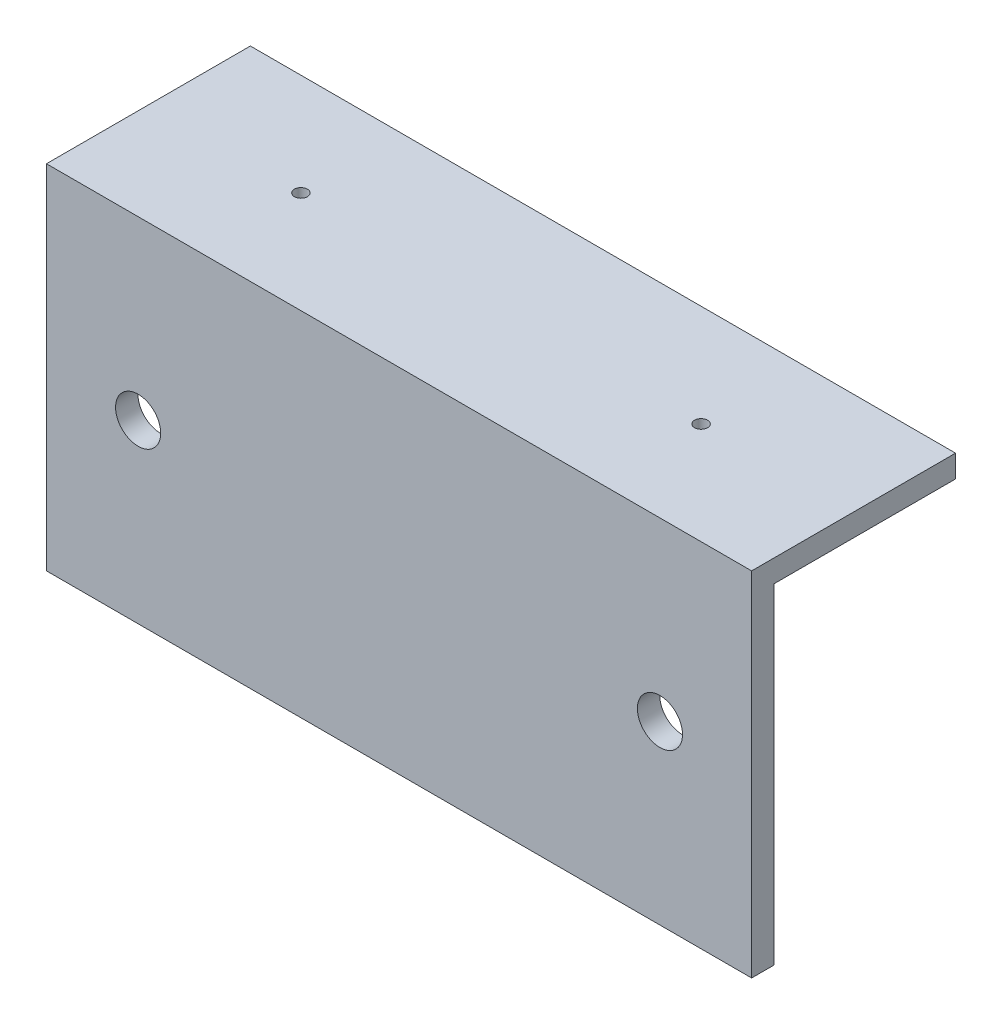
ISO-10303-21;
HEADER;
FILE_DESCRIPTION(('STEP AP214'),'2;1');
FILE_NAME('part.step','',(''),(''),'','','');
FILE_SCHEMA(('AUTOMOTIVE_DESIGN { 1 0 10303 214 1 1 1 1 }'));
ENDSEC;
DATA;
#1=APPLICATION_CONTEXT('core data for automotive mechanical design processes');
#2=APPLICATION_PROTOCOL_DEFINITION('international standard','automotive_design',2000,#1);
#3=PRODUCT_CONTEXT('',#1,'mechanical');
#4=PRODUCT('Part','Part','',(#3));
#5=PRODUCT_RELATED_PRODUCT_CATEGORY('part','',(#4));
#6=PRODUCT_DEFINITION_FORMATION('','',#4);
#7=PRODUCT_DEFINITION_CONTEXT('part definition',#1,'design');
#8=PRODUCT_DEFINITION('design','',#6,#7);
#9=PRODUCT_DEFINITION_SHAPE('','',#8);
#10=(LENGTH_UNIT() NAMED_UNIT(*) SI_UNIT(.MILLI.,.METRE.));
#11=(NAMED_UNIT(*) PLANE_ANGLE_UNIT() SI_UNIT($,.RADIAN.));
#12=(NAMED_UNIT(*) SI_UNIT($,.STERADIAN.) SOLID_ANGLE_UNIT());
#13=UNCERTAINTY_MEASURE_WITH_UNIT(LENGTH_MEASURE(1.E-05),#10,'distance_accuracy_value','');
#14=(GEOMETRIC_REPRESENTATION_CONTEXT(3) GLOBAL_UNCERTAINTY_ASSIGNED_CONTEXT((#13)) GLOBAL_UNIT_ASSIGNED_CONTEXT((#10,
#11,#12)) REPRESENTATION_CONTEXT('',''));
#15=CARTESIAN_POINT('',(0.,0.,0.));
#16=DIRECTION('',(0.,0.,1.));
#17=DIRECTION('',(1.,0.,0.));
#18=AXIS2_PLACEMENT_3D('',#15,#16,#17);
#19=CARTESIAN_POINT('',(25.,0.,1.5875));
#20=DIRECTION('',(-1.,0.,0.));
#21=DIRECTION('',(0.,0.,1.));
#22=AXIS2_PLACEMENT_3D('',#19,#20,#21);
#23=PLANE('',#22);
#24=DIRECTION('',(0.,1.,0.));
#25=VECTOR('',#24,1.);
#26=CARTESIAN_POINT('',(25.,0.,0.));
#27=LINE('',#26,#25);
#28=CARTESIAN_POINT('',(25.,-12.5,0.));
#29=VERTEX_POINT('',#28);
#30=CARTESIAN_POINT('',(25.,10.9125,0.));
#31=VERTEX_POINT('',#30);
#32=EDGE_CURVE('E118',#29,#31,#27,.T.);
#33=ORIENTED_EDGE('',*,*,#32,.T.);
#34=DIRECTION('',(0.,0.,-1.));
#35=VECTOR('',#34,1.);
#36=CARTESIAN_POINT('',(25.,10.9125,0.));
#37=LINE('',#36,#35);
#38=CARTESIAN_POINT('',(25.,10.9125,-12.8709783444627));
#39=VERTEX_POINT('',#38);
#40=EDGE_CURVE('E52',#31,#39,#37,.T.);
#41=ORIENTED_EDGE('',*,*,#40,.T.);
#42=DIRECTION('',(0.,1.,0.));
#43=VECTOR('',#42,1.);
#44=CARTESIAN_POINT('',(25.,10.9125,-12.8709783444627));
#45=LINE('',#44,#43);
#46=CARTESIAN_POINT('',(25.,12.5,-12.8709783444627));
#47=VERTEX_POINT('',#46);
#48=EDGE_CURVE('E101',#39,#47,#45,.T.);
#49=ORIENTED_EDGE('',*,*,#48,.T.);
#50=DIRECTION('',(0.,0.,-1.));
#51=VECTOR('',#50,1.);
#52=CARTESIAN_POINT('',(25.,12.5,1.5875));
#53=LINE('',#52,#51);
#54=CARTESIAN_POINT('',(25.,12.5,1.5875));
#55=VERTEX_POINT('',#54);
#56=EDGE_CURVE('E11',#55,#47,#53,.T.);
#57=ORIENTED_EDGE('',*,*,#56,.F.);
#58=DIRECTION('',(0.,1.,0.));
#59=VECTOR('',#58,1.);
#60=CARTESIAN_POINT('',(25.,0.,1.5875));
#61=LINE('',#60,#59);
#62=CARTESIAN_POINT('',(25.,-12.5,1.5875));
#63=VERTEX_POINT('',#62);
#64=EDGE_CURVE('E154',#63,#55,#61,.T.);
#65=ORIENTED_EDGE('',*,*,#64,.F.);
#66=DIRECTION('',(0.,0.,-1.));
#67=VECTOR('',#66,1.);
#68=CARTESIAN_POINT('',(25.,-12.5,1.5875));
#69=LINE('',#68,#67);
#70=EDGE_CURVE('E143',#63,#29,#69,.T.);
#71=ORIENTED_EDGE('',*,*,#70,.T.);
#72=EDGE_LOOP('',(#33,#41,#49,#57,#65,#71));
#73=FACE_BOUND('',#72,.T.);
#74=ADVANCED_FACE('F35',(#73),#23,.F.);
#75=CARTESIAN_POINT('',(0.,12.5,1.5875));
#76=DIRECTION('',(0.,-1.,0.));
#77=DIRECTION('',(0.,0.,-1.));
#78=AXIS2_PLACEMENT_3D('',#75,#76,#77);
#79=PLANE('',#78);
#80=CARTESIAN_POINT('',(-14.1859,12.5,-5.64173917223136));
#81=DIRECTION('',(0.,1.,0.));
#82=DIRECTION('',(0.,0.,1.));
#83=AXIS2_PLACEMENT_3D('',#80,#81,#82);
#84=CIRCLE('',#83,0.46355);
#85=CARTESIAN_POINT('',(-14.1859,12.5,-5.17818917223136));
#86=VERTEX_POINT('',#85);
#87=EDGE_CURVE('E216',#86,#86,#84,.T.);
#88=ORIENTED_EDGE('',*,*,#87,.F.);
#89=EDGE_LOOP('',(#88));
#90=FACE_BOUND('',#89,.T.);
#91=CARTESIAN_POINT('',(14.1859,12.5,-5.64173917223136));
#92=DIRECTION('',(0.,1.,0.));
#93=DIRECTION('',(0.,0.,1.));
#94=AXIS2_PLACEMENT_3D('',#91,#92,#93);
#95=CIRCLE('',#94,0.46355);
#96=CARTESIAN_POINT('',(14.1859,12.5,-5.17818917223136));
#97=VERTEX_POINT('',#96);
#98=EDGE_CURVE('E218',#97,#97,#95,.T.);
#99=ORIENTED_EDGE('',*,*,#98,.F.);
#100=EDGE_LOOP('',(#99));
#101=FACE_BOUND('',#100,.T.);
#102=ORIENTED_EDGE('',*,*,#56,.T.);
#103=DIRECTION('',(-1.,0.,0.));
#104=VECTOR('',#103,1.);
#105=CARTESIAN_POINT('',(25.,12.5,-12.8709783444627));
#106=LINE('',#105,#104);
#107=CARTESIAN_POINT('',(-25.,12.5,-12.8709783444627));
#108=VERTEX_POINT('',#107);
#109=EDGE_CURVE('E106',#47,#108,#106,.T.);
#110=ORIENTED_EDGE('',*,*,#109,.T.);
#111=DIRECTION('',(0.,0.,-1.));
#112=VECTOR('',#111,1.);
#113=CARTESIAN_POINT('',(-25.,12.5,1.5875));
#114=LINE('',#113,#112);
#115=CARTESIAN_POINT('',(-25.,12.5,1.5875));
#116=VERTEX_POINT('',#115);
#117=EDGE_CURVE('E44',#116,#108,#114,.T.);
#118=ORIENTED_EDGE('',*,*,#117,.F.);
#119=DIRECTION('',(-1.,0.,0.));
#120=VECTOR('',#119,1.);
#121=CARTESIAN_POINT('',(0.,12.5,1.5875));
#122=LINE('',#121,#120);
#123=EDGE_CURVE('E83',#55,#116,#122,.T.);
#124=ORIENTED_EDGE('',*,*,#123,.F.);
#125=EDGE_LOOP('',(#102,#110,#118,#124));
#126=FACE_BOUND('',#125,.T.);
#127=ADVANCED_FACE('F152',(#90,#101,#126),#79,.F.);
#128=CARTESIAN_POINT('',(-25.,0.,1.5875));
#129=DIRECTION('',(1.,0.,0.));
#130=DIRECTION('',(0.,0.,-1.));
#131=AXIS2_PLACEMENT_3D('',#128,#129,#130);
#132=PLANE('',#131);
#133=ORIENTED_EDGE('',*,*,#117,.T.);
#134=DIRECTION('',(0.,1.,0.));
#135=VECTOR('',#134,1.);
#136=CARTESIAN_POINT('',(-25.,10.9125,-12.8709783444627));
#137=LINE('',#136,#135);
#138=CARTESIAN_POINT('',(-25.,10.9125,-12.8709783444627));
#139=VERTEX_POINT('',#138);
#140=EDGE_CURVE('E109',#139,#108,#137,.T.);
#141=ORIENTED_EDGE('',*,*,#140,.F.);
#142=DIRECTION('',(0.,0.,1.));
#143=VECTOR('',#142,1.);
#144=CARTESIAN_POINT('',(-25.,10.9125,-12.8709783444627));
#145=LINE('',#144,#143);
#146=CARTESIAN_POINT('',(-25.,10.9125,0.));
#147=VERTEX_POINT('',#146);
#148=EDGE_CURVE('E114',#139,#147,#145,.T.);
#149=ORIENTED_EDGE('',*,*,#148,.T.);
#150=DIRECTION('',(0.,-1.,0.));
#151=VECTOR('',#150,1.);
#152=CARTESIAN_POINT('',(-25.,0.,0.));
#153=LINE('',#152,#151);
#154=CARTESIAN_POINT('',(-25.,-12.5,0.));
#155=VERTEX_POINT('',#154);
#156=EDGE_CURVE('E131',#147,#155,#153,.T.);
#157=ORIENTED_EDGE('',*,*,#156,.T.);
#158=DIRECTION('',(0.,0.,-1.));
#159=VECTOR('',#158,1.);
#160=CARTESIAN_POINT('',(-25.,-12.5,1.5875));
#161=LINE('',#160,#159);
#162=CARTESIAN_POINT('',(-25.,-12.5,1.5875));
#163=VERTEX_POINT('',#162);
#164=EDGE_CURVE('E145',#163,#155,#161,.T.);
#165=ORIENTED_EDGE('',*,*,#164,.F.);
#166=DIRECTION('',(0.,-1.,0.));
#167=VECTOR('',#166,1.);
#168=CARTESIAN_POINT('',(-25.,0.,1.5875));
#169=LINE('',#168,#167);
#170=EDGE_CURVE('E149',#116,#163,#169,.T.);
#171=ORIENTED_EDGE('',*,*,#170,.F.);
#172=EDGE_LOOP('',(#133,#141,#149,#157,#165,#171));
#173=FACE_BOUND('',#172,.T.);
#174=ADVANCED_FACE('F148',(#173),#132,.F.);
#175=CARTESIAN_POINT('',(-18.5,0.,1.5875));
#176=DIRECTION('',(0.,0.,-1.));
#177=DIRECTION('',(-1.,0.,0.));
#178=AXIS2_PLACEMENT_3D('',#175,#176,#177);
#179=CYLINDRICAL_SURFACE('',#178,1.6);
#180=CARTESIAN_POINT('',(-18.5,0.,1.5875));
#181=DIRECTION('',(0.,0.,1.));
#182=DIRECTION('',(1.,0.,0.));
#183=AXIS2_PLACEMENT_3D('',#180,#181,#182);
#184=CIRCLE('',#183,1.6);
#185=CARTESIAN_POINT('',(-16.9,0.,1.5875));
#186=VERTEX_POINT('',#185);
#187=EDGE_CURVE('E155',#186,#186,#184,.T.);
#188=ORIENTED_EDGE('',*,*,#187,.T.);
#189=EDGE_LOOP('',(#188));
#190=FACE_BOUND('',#189,.T.);
#191=CARTESIAN_POINT('',(-18.5,0.,0.));
#192=DIRECTION('',(0.,0.,1.));
#193=DIRECTION('',(1.,0.,0.));
#194=AXIS2_PLACEMENT_3D('',#191,#192,#193);
#195=CIRCLE('',#194,1.6);
#196=CARTESIAN_POINT('',(-16.9,0.,0.));
#197=VERTEX_POINT('',#196);
#198=EDGE_CURVE('E135',#197,#197,#195,.T.);
#199=ORIENTED_EDGE('',*,*,#198,.F.);
#200=EDGE_LOOP('',(#199));
#201=FACE_BOUND('',#200,.T.);
#202=ADVANCED_FACE('F169',(#190,#201),#179,.F.);
#203=CARTESIAN_POINT('',(18.5,0.,1.5875));
#204=DIRECTION('',(0.,0.,-1.));
#205=DIRECTION('',(-1.,0.,0.));
#206=AXIS2_PLACEMENT_3D('',#203,#204,#205);
#207=CYLINDRICAL_SURFACE('',#206,1.6);
#208=CARTESIAN_POINT('',(18.5,0.,1.5875));
#209=DIRECTION('',(0.,0.,1.));
#210=DIRECTION('',(1.,0.,0.));
#211=AXIS2_PLACEMENT_3D('',#208,#209,#210);
#212=CIRCLE('',#211,1.6);
#213=CARTESIAN_POINT('',(20.1,0.,1.5875));
#214=VERTEX_POINT('',#213);
#215=EDGE_CURVE('E133',#214,#214,#212,.T.);
#216=ORIENTED_EDGE('',*,*,#215,.T.);
#217=EDGE_LOOP('',(#216));
#218=FACE_BOUND('',#217,.T.);
#219=CARTESIAN_POINT('',(18.5,0.,0.));
#220=DIRECTION('',(0.,0.,1.));
#221=DIRECTION('',(1.,0.,0.));
#222=AXIS2_PLACEMENT_3D('',#219,#220,#221);
#223=CIRCLE('',#222,1.6);
#224=CARTESIAN_POINT('',(20.1,0.,0.));
#225=VERTEX_POINT('',#224);
#226=EDGE_CURVE('E150',#225,#225,#223,.T.);
#227=ORIENTED_EDGE('',*,*,#226,.F.);
#228=EDGE_LOOP('',(#227));
#229=FACE_BOUND('',#228,.T.);
#230=ADVANCED_FACE('F37',(#218,#229),#207,.F.);
#231=CARTESIAN_POINT('',(0.,-12.5,1.5875));
#232=DIRECTION('',(0.,1.,0.));
#233=DIRECTION('',(0.,0.,1.));
#234=AXIS2_PLACEMENT_3D('',#231,#232,#233);
#235=PLANE('',#234);
#236=DIRECTION('',(1.,0.,0.));
#237=VECTOR('',#236,1.);
#238=CARTESIAN_POINT('',(0.,-12.5,0.));
#239=LINE('',#238,#237);
#240=EDGE_CURVE('E76',#155,#29,#239,.T.);
#241=ORIENTED_EDGE('',*,*,#240,.T.);
#242=ORIENTED_EDGE('',*,*,#70,.F.);
#243=DIRECTION('',(1.,0.,0.));
#244=VECTOR('',#243,1.);
#245=CARTESIAN_POINT('',(0.,-12.5,1.5875));
#246=LINE('',#245,#244);
#247=EDGE_CURVE('E61',#163,#63,#246,.T.);
#248=ORIENTED_EDGE('',*,*,#247,.F.);
#249=ORIENTED_EDGE('',*,*,#164,.T.);
#250=EDGE_LOOP('',(#241,#242,#248,#249));
#251=FACE_BOUND('',#250,.T.);
#252=ADVANCED_FACE('F176',(#251),#235,.F.);
#253=CARTESIAN_POINT('',(0.,0.,1.5875));
#254=DIRECTION('',(0.,0.,1.));
#255=DIRECTION('',(1.,0.,0.));
#256=AXIS2_PLACEMENT_3D('',#253,#254,#255);
#257=PLANE('',#256);
#258=ORIENTED_EDGE('',*,*,#215,.F.);
#259=EDGE_LOOP('',(#258));
#260=FACE_BOUND('',#259,.T.);
#261=ORIENTED_EDGE('',*,*,#187,.F.);
#262=EDGE_LOOP('',(#261));
#263=FACE_BOUND('',#262,.T.);
#264=ORIENTED_EDGE('',*,*,#64,.T.);
#265=ORIENTED_EDGE('',*,*,#123,.T.);
#266=ORIENTED_EDGE('',*,*,#170,.T.);
#267=ORIENTED_EDGE('',*,*,#247,.T.);
#268=EDGE_LOOP('',(#264,#265,#266,#267));
#269=FACE_BOUND('',#268,.T.);
#270=ADVANCED_FACE('F189',(#260,#263,#269),#257,.T.);
#271=CARTESIAN_POINT('',(0.,0.,0.));
#272=DIRECTION('',(0.,0.,1.));
#273=DIRECTION('',(1.,0.,0.));
#274=AXIS2_PLACEMENT_3D('',#271,#272,#273);
#275=PLANE('',#274);
#276=ORIENTED_EDGE('',*,*,#226,.T.);
#277=EDGE_LOOP('',(#276));
#278=FACE_BOUND('',#277,.T.);
#279=ORIENTED_EDGE('',*,*,#198,.T.);
#280=EDGE_LOOP('',(#279));
#281=FACE_BOUND('',#280,.T.);
#282=ORIENTED_EDGE('',*,*,#156,.F.);
#283=DIRECTION('',(1.,0.,0.));
#284=VECTOR('',#283,1.);
#285=CARTESIAN_POINT('',(-25.,10.9125,0.));
#286=LINE('',#285,#284);
#287=EDGE_CURVE('E110',#147,#31,#286,.T.);
#288=ORIENTED_EDGE('',*,*,#287,.T.);
#289=ORIENTED_EDGE('',*,*,#32,.F.);
#290=ORIENTED_EDGE('',*,*,#240,.F.);
#291=EDGE_LOOP('',(#282,#288,#289,#290));
#292=FACE_BOUND('',#291,.T.);
#293=ADVANCED_FACE('F130',(#278,#281,#292),#275,.F.);
#294=CARTESIAN_POINT('',(25.,10.9125,-12.8709783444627));
#295=DIRECTION('',(0.,0.,-1.));
#296=DIRECTION('',(-1.,0.,0.));
#297=AXIS2_PLACEMENT_3D('',#294,#295,#296);
#298=PLANE('',#297);
#299=ORIENTED_EDGE('',*,*,#109,.F.);
#300=ORIENTED_EDGE('',*,*,#48,.F.);
#301=DIRECTION('',(-1.,0.,0.));
#302=VECTOR('',#301,1.);
#303=CARTESIAN_POINT('',(25.,10.9125,-12.8709783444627));
#304=LINE('',#303,#302);
#305=EDGE_CURVE('E104',#39,#139,#304,.T.);
#306=ORIENTED_EDGE('',*,*,#305,.T.);
#307=ORIENTED_EDGE('',*,*,#140,.T.);
#308=EDGE_LOOP('',(#299,#300,#306,#307));
#309=FACE_BOUND('',#308,.T.);
#310=ADVANCED_FACE('F102',(#309),#298,.T.);
#311=CARTESIAN_POINT('',(0.,10.9125,0.));
#312=DIRECTION('',(0.,1.,0.));
#313=DIRECTION('',(0.,0.,1.));
#314=AXIS2_PLACEMENT_3D('',#311,#312,#313);
#315=PLANE('',#314);
#316=CARTESIAN_POINT('',(-14.1859,10.9125,-5.64173917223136));
#317=DIRECTION('',(0.,1.,0.));
#318=DIRECTION('',(0.,0.,1.));
#319=AXIS2_PLACEMENT_3D('',#316,#317,#318);
#320=CIRCLE('',#319,0.46355);
#321=CARTESIAN_POINT('',(-14.1859,10.9125,-5.17818917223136));
#322=VERTEX_POINT('',#321);
#323=EDGE_CURVE('E213',#322,#322,#320,.T.);
#324=ORIENTED_EDGE('',*,*,#323,.T.);
#325=EDGE_LOOP('',(#324));
#326=FACE_BOUND('',#325,.T.);
#327=CARTESIAN_POINT('',(14.1859,10.9125,-5.64173917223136));
#328=DIRECTION('',(0.,1.,0.));
#329=DIRECTION('',(0.,0.,1.));
#330=AXIS2_PLACEMENT_3D('',#327,#328,#329);
#331=CIRCLE('',#330,0.46355);
#332=CARTESIAN_POINT('',(14.1859,10.9125,-5.17818917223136));
#333=VERTEX_POINT('',#332);
#334=EDGE_CURVE('E120',#333,#333,#331,.T.);
#335=ORIENTED_EDGE('',*,*,#334,.T.);
#336=EDGE_LOOP('',(#335));
#337=FACE_BOUND('',#336,.T.);
#338=ORIENTED_EDGE('',*,*,#40,.F.);
#339=ORIENTED_EDGE('',*,*,#287,.F.);
#340=ORIENTED_EDGE('',*,*,#148,.F.);
#341=ORIENTED_EDGE('',*,*,#305,.F.);
#342=EDGE_LOOP('',(#338,#339,#340,#341));
#343=FACE_BOUND('',#342,.T.);
#344=ADVANCED_FACE('F113',(#326,#337,#343),#315,.F.);
#345=CARTESIAN_POINT('',(14.1859,10.9125,-5.64173917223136));
#346=DIRECTION('',(0.,1.,0.));
#347=DIRECTION('',(0.,0.,1.));
#348=AXIS2_PLACEMENT_3D('',#345,#346,#347);
#349=CYLINDRICAL_SURFACE('',#348,0.46355);
#350=ORIENTED_EDGE('',*,*,#334,.F.);
#351=EDGE_LOOP('',(#350));
#352=FACE_BOUND('',#351,.T.);
#353=ORIENTED_EDGE('',*,*,#98,.T.);
#354=EDGE_LOOP('',(#353));
#355=FACE_BOUND('',#354,.T.);
#356=ADVANCED_FACE('F200',(#352,#355),#349,.F.);
#357=CARTESIAN_POINT('',(-14.1859,10.9125,-5.64173917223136));
#358=DIRECTION('',(0.,1.,0.));
#359=DIRECTION('',(0.,0.,1.));
#360=AXIS2_PLACEMENT_3D('',#357,#358,#359);
#361=CYLINDRICAL_SURFACE('',#360,0.46355);
#362=ORIENTED_EDGE('',*,*,#323,.F.);
#363=EDGE_LOOP('',(#362));
#364=FACE_BOUND('',#363,.T.);
#365=ORIENTED_EDGE('',*,*,#87,.T.);
#366=EDGE_LOOP('',(#365));
#367=FACE_BOUND('',#366,.T.);
#368=ADVANCED_FACE('F204',(#364,#367),#361,.F.);
#369=CLOSED_SHELL('',(#74,#127,#174,#202,#230,#252,#270,#293,#310,#344,#356,#368));
#370=MANIFOLD_SOLID_BREP('B2',#369);
#371=ADVANCED_BREP_SHAPE_REPRESENTATION('',(#18,#370),#14);
#372=SHAPE_DEFINITION_REPRESENTATION(#9,#371);
ENDSEC;
END-ISO-10303-21;
